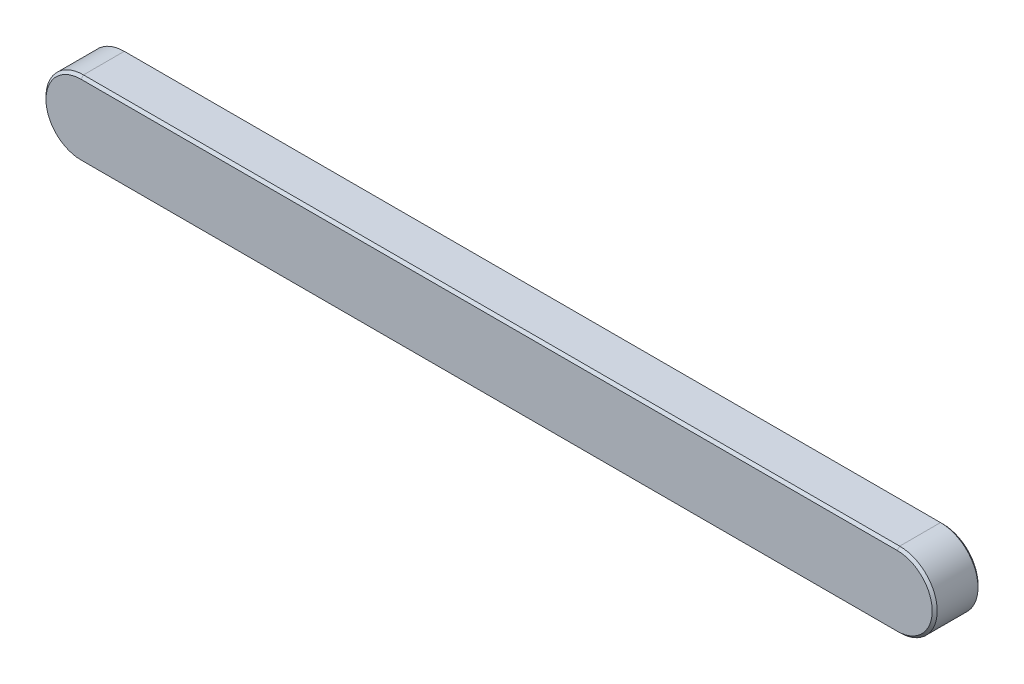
ISO-10303-21;
HEADER;
FILE_DESCRIPTION(('STEP AP214'),'2;1');
FILE_NAME('part.step','',(''),(''),'','','');
FILE_SCHEMA(('AUTOMOTIVE_DESIGN { 1 0 10303 214 1 1 1 1 }'));
ENDSEC;
DATA;
#1=APPLICATION_CONTEXT('core data for automotive mechanical design processes');
#2=APPLICATION_PROTOCOL_DEFINITION('international standard','automotive_design',2000,#1);
#3=PRODUCT_CONTEXT('',#1,'mechanical');
#4=PRODUCT('Part','Part','',(#3));
#5=PRODUCT_RELATED_PRODUCT_CATEGORY('part','',(#4));
#6=PRODUCT_DEFINITION_FORMATION('','',#4);
#7=PRODUCT_DEFINITION_CONTEXT('part definition',#1,'design');
#8=PRODUCT_DEFINITION('design','',#6,#7);
#9=PRODUCT_DEFINITION_SHAPE('','',#8);
#10=(LENGTH_UNIT() NAMED_UNIT(*) SI_UNIT(.MILLI.,.METRE.));
#11=(NAMED_UNIT(*) PLANE_ANGLE_UNIT() SI_UNIT($,.RADIAN.));
#12=(NAMED_UNIT(*) SI_UNIT($,.STERADIAN.) SOLID_ANGLE_UNIT());
#13=UNCERTAINTY_MEASURE_WITH_UNIT(LENGTH_MEASURE(1.E-05),#10,'distance_accuracy_value','');
#14=(GEOMETRIC_REPRESENTATION_CONTEXT(3) GLOBAL_UNCERTAINTY_ASSIGNED_CONTEXT((#13)) GLOBAL_UNIT_ASSIGNED_CONTEXT((#10,
#11,#12)) REPRESENTATION_CONTEXT('',''));
#15=CARTESIAN_POINT('',(0.,0.,0.));
#16=DIRECTION('',(0.,0.,1.));
#17=DIRECTION('',(1.,0.,0.));
#18=AXIS2_PLACEMENT_3D('',#15,#16,#17);
#19=CARTESIAN_POINT('',(0.,9.,11.));
#20=DIRECTION('',(0.,0.,-1.));
#21=DIRECTION('',(-1.,0.,0.));
#22=AXIS2_PLACEMENT_3D('',#19,#20,#21);
#23=CYLINDRICAL_SURFACE('',#22,9.);
#24=DIRECTION('',(0.,0.,-1.));
#25=VECTOR('',#24,1.);
#26=CARTESIAN_POINT('',(0.,0.,11.));
#27=LINE('',#26,#25);
#28=CARTESIAN_POINT('',(0.,0.,10.4));
#29=VERTEX_POINT('',#28);
#30=CARTESIAN_POINT('',(0.,0.,0.600000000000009));
#31=VERTEX_POINT('',#30);
#32=EDGE_CURVE('E117',#29,#31,#27,.T.);
#33=ORIENTED_EDGE('',*,*,#32,.F.);
#34=CARTESIAN_POINT('',(0.,9.,10.4));
#35=DIRECTION('',(0.,0.,-1.));
#36=DIRECTION('',(-1.,0.,0.));
#37=AXIS2_PLACEMENT_3D('',#34,#35,#36);
#38=CIRCLE('',#37,9.);
#39=CARTESIAN_POINT('',(0.,18.,10.4));
#40=VERTEX_POINT('',#39);
#41=EDGE_CURVE('E141',#29,#40,#38,.T.);
#42=ORIENTED_EDGE('',*,*,#41,.T.);
#43=DIRECTION('',(0.,0.,-1.));
#44=VECTOR('',#43,1.);
#45=CARTESIAN_POINT('',(0.,18.,11.));
#46=LINE('',#45,#44);
#47=CARTESIAN_POINT('',(0.,18.,0.600000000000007));
#48=VERTEX_POINT('',#47);
#49=EDGE_CURVE('E152',#40,#48,#46,.T.);
#50=ORIENTED_EDGE('',*,*,#49,.T.);
#51=CARTESIAN_POINT('',(-1.11022302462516E-13,9.,0.600000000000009));
#52=DIRECTION('',(0.,0.,-1.));
#53=DIRECTION('',(-1.,0.,0.));
#54=AXIS2_PLACEMENT_3D('',#51,#52,#53);
#55=CIRCLE('',#54,9.);
#56=EDGE_CURVE('E139',#48,#31,#55,.F.);
#57=ORIENTED_EDGE('',*,*,#56,.T.);
#58=EDGE_LOOP('',(#33,#42,#50,#57));
#59=FACE_BOUND('',#58,.T.);
#60=ADVANCED_FACE('F32',(#59),#23,.T.);
#61=CARTESIAN_POINT('',(0.,0.,11.));
#62=DIRECTION('',(0.,1.,0.));
#63=DIRECTION('',(-1.,0.,0.));
#64=AXIS2_PLACEMENT_3D('',#61,#62,#63);
#65=PLANE('',#64);
#66=DIRECTION('',(0.,0.,-1.));
#67=VECTOR('',#66,1.);
#68=CARTESIAN_POINT('',(196.,0.,11.));
#69=LINE('',#68,#67);
#70=CARTESIAN_POINT('',(196.,0.,10.4));
#71=VERTEX_POINT('',#70);
#72=CARTESIAN_POINT('',(196.,0.,0.600000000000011));
#73=VERTEX_POINT('',#72);
#74=EDGE_CURVE('E279',#71,#73,#69,.T.);
#75=ORIENTED_EDGE('',*,*,#74,.F.);
#76=DIRECTION('',(-1.,0.,0.));
#77=VECTOR('',#76,1.);
#78=CARTESIAN_POINT('',(0.,0.,10.4));
#79=LINE('',#78,#77);
#80=EDGE_CURVE('E137',#71,#29,#79,.T.);
#81=ORIENTED_EDGE('',*,*,#80,.T.);
#82=ORIENTED_EDGE('',*,*,#32,.T.);
#83=DIRECTION('',(1.,0.,0.));
#84=VECTOR('',#83,1.);
#85=CARTESIAN_POINT('',(196.,0.,0.600000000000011));
#86=LINE('',#85,#84);
#87=EDGE_CURVE('E134',#31,#73,#86,.T.);
#88=ORIENTED_EDGE('',*,*,#87,.T.);
#89=EDGE_LOOP('',(#75,#81,#82,#88));
#90=FACE_BOUND('',#89,.T.);
#91=ADVANCED_FACE('F189',(#90),#65,.F.);
#92=CARTESIAN_POINT('',(196.,9.,11.));
#93=DIRECTION('',(0.,0.,-1.));
#94=DIRECTION('',(-1.,0.,0.));
#95=AXIS2_PLACEMENT_3D('',#92,#93,#94);
#96=CYLINDRICAL_SURFACE('',#95,9.);
#97=DIRECTION('',(0.,0.,-1.));
#98=VECTOR('',#97,1.);
#99=CARTESIAN_POINT('',(196.,18.,11.));
#100=LINE('',#99,#98);
#101=CARTESIAN_POINT('',(196.,18.,10.4));
#102=VERTEX_POINT('',#101);
#103=CARTESIAN_POINT('',(196.,18.,0.600000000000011));
#104=VERTEX_POINT('',#103);
#105=EDGE_CURVE('E275',#102,#104,#100,.T.);
#106=ORIENTED_EDGE('',*,*,#105,.F.);
#107=CARTESIAN_POINT('',(196.,9.,10.4));
#108=DIRECTION('',(0.,0.,-1.));
#109=DIRECTION('',(-1.,0.,0.));
#110=AXIS2_PLACEMENT_3D('',#107,#108,#109);
#111=CIRCLE('',#110,9.);
#112=EDGE_CURVE('E132',#102,#71,#111,.T.);
#113=ORIENTED_EDGE('',*,*,#112,.T.);
#114=ORIENTED_EDGE('',*,*,#74,.T.);
#115=CARTESIAN_POINT('',(196.,9.00000000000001,0.600000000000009));
#116=DIRECTION('',(0.,0.,-1.));
#117=DIRECTION('',(-1.,0.,0.));
#118=AXIS2_PLACEMENT_3D('',#115,#116,#117);
#119=CIRCLE('',#118,9.);
#120=EDGE_CURVE('E130',#73,#104,#119,.F.);
#121=ORIENTED_EDGE('',*,*,#120,.T.);
#122=EDGE_LOOP('',(#106,#113,#114,#121));
#123=FACE_BOUND('',#122,.T.);
#124=ADVANCED_FACE('F195',(#123),#96,.T.);
#125=CARTESIAN_POINT('',(0.,18.,11.));
#126=DIRECTION('',(0.,-1.,0.));
#127=DIRECTION('',(0.,0.,-1.));
#128=AXIS2_PLACEMENT_3D('',#125,#126,#127);
#129=PLANE('',#128);
#130=ORIENTED_EDGE('',*,*,#49,.F.);
#131=DIRECTION('',(1.,0.,0.));
#132=VECTOR('',#131,1.);
#133=CARTESIAN_POINT('',(0.,18.,10.4));
#134=LINE('',#133,#132);
#135=EDGE_CURVE('E104',#40,#102,#134,.T.);
#136=ORIENTED_EDGE('',*,*,#135,.T.);
#137=ORIENTED_EDGE('',*,*,#105,.T.);
#138=DIRECTION('',(-1.,0.,0.));
#139=VECTOR('',#138,1.);
#140=CARTESIAN_POINT('',(0.,18.,0.600000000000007));
#141=LINE('',#140,#139);
#142=EDGE_CURVE('E123',#104,#48,#141,.T.);
#143=ORIENTED_EDGE('',*,*,#142,.T.);
#144=EDGE_LOOP('',(#130,#136,#137,#143));
#145=FACE_BOUND('',#144,.T.);
#146=ADVANCED_FACE('F185',(#145),#129,.F.);
#147=CARTESIAN_POINT('',(0.,9.,11.));
#148=DIRECTION('',(0.,0.,-1.));
#149=DIRECTION('',(-1.,0.,0.));
#150=AXIS2_PLACEMENT_3D('',#147,#148,#149);
#151=PLANE('',#150);
#152=CARTESIAN_POINT('',(196.,9.,11.));
#153=DIRECTION('',(0.,0.,-1.));
#154=DIRECTION('',(-1.,0.,0.));
#155=AXIS2_PLACEMENT_3D('',#152,#153,#154);
#156=CIRCLE('',#155,8.39999999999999);
#157=CARTESIAN_POINT('',(196.,0.600000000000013,11.));
#158=VERTEX_POINT('',#157);
#159=CARTESIAN_POINT('',(196.,17.4,11.));
#160=VERTEX_POINT('',#159);
#161=EDGE_CURVE('E121',#158,#160,#156,.F.);
#162=ORIENTED_EDGE('',*,*,#161,.T.);
#163=DIRECTION('',(-1.,0.,0.));
#164=VECTOR('',#163,1.);
#165=CARTESIAN_POINT('',(0.,17.4,11.));
#166=LINE('',#165,#164);
#167=CARTESIAN_POINT('',(0.,17.4,11.));
#168=VERTEX_POINT('',#167);
#169=EDGE_CURVE('E102',#160,#168,#166,.T.);
#170=ORIENTED_EDGE('',*,*,#169,.T.);
#171=CARTESIAN_POINT('',(0.,9.,11.));
#172=DIRECTION('',(0.,0.,-1.));
#173=DIRECTION('',(-1.,0.,0.));
#174=AXIS2_PLACEMENT_3D('',#171,#172,#173);
#175=CIRCLE('',#174,8.4);
#176=CARTESIAN_POINT('',(0.,0.599999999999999,11.));
#177=VERTEX_POINT('',#176);
#178=EDGE_CURVE('E110',#168,#177,#175,.F.);
#179=ORIENTED_EDGE('',*,*,#178,.T.);
#180=DIRECTION('',(1.,0.,0.));
#181=VECTOR('',#180,1.);
#182=CARTESIAN_POINT('',(0.,0.60000000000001,11.));
#183=LINE('',#182,#181);
#184=EDGE_CURVE('E116',#177,#158,#183,.T.);
#185=ORIENTED_EDGE('',*,*,#184,.T.);
#186=EDGE_LOOP('',(#162,#170,#179,#185));
#187=FACE_BOUND('',#186,.T.);
#188=ADVANCED_FACE('F119',(#187),#151,.F.);
#189=CARTESIAN_POINT('',(-1.11022302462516E-13,9.,0.));
#190=DIRECTION('',(0.,0.,-1.));
#191=DIRECTION('',(-1.,0.,0.));
#192=AXIS2_PLACEMENT_3D('',#189,#190,#191);
#193=PLANE('',#192);
#194=CARTESIAN_POINT('',(196.,9.00000000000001,0.));
#195=DIRECTION('',(0.,0.,-1.));
#196=DIRECTION('',(-1.,0.,0.));
#197=AXIS2_PLACEMENT_3D('',#194,#195,#196);
#198=CIRCLE('',#197,8.4);
#199=CARTESIAN_POINT('',(196.,17.4,0.));
#200=VERTEX_POINT('',#199);
#201=CARTESIAN_POINT('',(196.,0.600000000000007,0.));
#202=VERTEX_POINT('',#201);
#203=EDGE_CURVE('E41',#200,#202,#198,.T.);
#204=ORIENTED_EDGE('',*,*,#203,.T.);
#205=DIRECTION('',(-1.,0.,0.));
#206=VECTOR('',#205,1.);
#207=CARTESIAN_POINT('',(0.,0.600000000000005,0.));
#208=LINE('',#207,#206);
#209=CARTESIAN_POINT('',(0.,0.599999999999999,0.));
#210=VERTEX_POINT('',#209);
#211=EDGE_CURVE('E11',#202,#210,#208,.T.);
#212=ORIENTED_EDGE('',*,*,#211,.T.);
#213=CARTESIAN_POINT('',(-1.11022302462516E-13,9.,0.));
#214=DIRECTION('',(0.,0.,-1.));
#215=DIRECTION('',(-1.,0.,0.));
#216=AXIS2_PLACEMENT_3D('',#213,#214,#215);
#217=CIRCLE('',#216,8.4);
#218=CARTESIAN_POINT('',(0.,17.4,0.));
#219=VERTEX_POINT('',#218);
#220=EDGE_CURVE('E143',#210,#219,#217,.T.);
#221=ORIENTED_EDGE('',*,*,#220,.T.);
#222=DIRECTION('',(1.,0.,0.));
#223=VECTOR('',#222,1.);
#224=CARTESIAN_POINT('',(196.,17.4,0.));
#225=LINE('',#224,#223);
#226=EDGE_CURVE('E52',#219,#200,#225,.T.);
#227=ORIENTED_EDGE('',*,*,#226,.T.);
#228=EDGE_LOOP('',(#204,#212,#221,#227));
#229=FACE_BOUND('',#228,.T.);
#230=ADVANCED_FACE('F174',(#229),#193,.T.);
#231=CARTESIAN_POINT('',(0.,0.60000000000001,11.));
#232=DIRECTION('',(0.,0.707106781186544,-0.707106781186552));
#233=DIRECTION('',(0.,0.707106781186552,0.707106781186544));
#234=AXIS2_PLACEMENT_3D('',#231,#232,#233);
#235=PLANE('',#234);
#236=DIRECTION('',(0.,0.707106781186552,0.707106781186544));
#237=VECTOR('',#236,1.);
#238=CARTESIAN_POINT('',(0.,0.,10.4));
#239=LINE('',#238,#237);
#240=EDGE_CURVE('E113',#29,#177,#239,.T.);
#241=ORIENTED_EDGE('',*,*,#240,.F.);
#242=ORIENTED_EDGE('',*,*,#80,.F.);
#243=DIRECTION('',(0.,-0.707106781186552,-0.707106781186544));
#244=VECTOR('',#243,1.);
#245=CARTESIAN_POINT('',(196.,0.600000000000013,11.));
#246=LINE('',#245,#244);
#247=EDGE_CURVE('E149',#158,#71,#246,.T.);
#248=ORIENTED_EDGE('',*,*,#247,.F.);
#249=ORIENTED_EDGE('',*,*,#184,.F.);
#250=EDGE_LOOP('',(#241,#242,#248,#249));
#251=FACE_BOUND('',#250,.T.);
#252=ADVANCED_FACE('F176',(#251),#235,.F.);
#253=CARTESIAN_POINT('',(196.,9.,11.));
#254=DIRECTION('',(0.,0.,-1.));
#255=DIRECTION('',(-1.,0.,0.));
#256=AXIS2_PLACEMENT_3D('',#253,#254,#255);
#257=CONICAL_SURFACE('',#256,8.39999999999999,0.785398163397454);
#258=ORIENTED_EDGE('',*,*,#247,.T.);
#259=ORIENTED_EDGE('',*,*,#112,.F.);
#260=DIRECTION('',(0.,0.707106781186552,-0.707106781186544));
#261=VECTOR('',#260,1.);
#262=CARTESIAN_POINT('',(196.,17.4,11.));
#263=LINE('',#262,#261);
#264=EDGE_CURVE('E107',#160,#102,#263,.T.);
#265=ORIENTED_EDGE('',*,*,#264,.F.);
#266=ORIENTED_EDGE('',*,*,#161,.F.);
#267=EDGE_LOOP('',(#258,#259,#265,#266));
#268=FACE_BOUND('',#267,.T.);
#269=ADVANCED_FACE('F182',(#268),#257,.T.);
#270=CARTESIAN_POINT('',(0.,9.,11.));
#271=DIRECTION('',(0.,0.,-1.));
#272=DIRECTION('',(-1.,0.,0.));
#273=AXIS2_PLACEMENT_3D('',#270,#271,#272);
#274=CONICAL_SURFACE('',#273,8.4,0.785398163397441);
#275=ORIENTED_EDGE('',*,*,#240,.T.);
#276=ORIENTED_EDGE('',*,*,#178,.F.);
#277=DIRECTION('',(0.,-0.707106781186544,0.707106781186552));
#278=VECTOR('',#277,1.);
#279=CARTESIAN_POINT('',(0.,18.,10.4));
#280=LINE('',#279,#278);
#281=EDGE_CURVE('E98',#40,#168,#280,.T.);
#282=ORIENTED_EDGE('',*,*,#281,.F.);
#283=ORIENTED_EDGE('',*,*,#41,.F.);
#284=EDGE_LOOP('',(#275,#276,#282,#283));
#285=FACE_BOUND('',#284,.T.);
#286=ADVANCED_FACE('F111',(#285),#274,.T.);
#287=CARTESIAN_POINT('',(0.,17.4,11.));
#288=DIRECTION('',(0.,-0.707106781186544,-0.707106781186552));
#289=DIRECTION('',(0.,0.707106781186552,-0.707106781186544));
#290=AXIS2_PLACEMENT_3D('',#287,#288,#289);
#291=PLANE('',#290);
#292=ORIENTED_EDGE('',*,*,#264,.T.);
#293=ORIENTED_EDGE('',*,*,#135,.F.);
#294=ORIENTED_EDGE('',*,*,#281,.T.);
#295=ORIENTED_EDGE('',*,*,#169,.F.);
#296=EDGE_LOOP('',(#292,#293,#294,#295));
#297=FACE_BOUND('',#296,.T.);
#298=ADVANCED_FACE('F100',(#297),#291,.F.);
#299=CARTESIAN_POINT('',(0.,18.,0.600000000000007));
#300=DIRECTION('',(0.,0.707106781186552,-0.707106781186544));
#301=DIRECTION('',(0.,0.707106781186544,0.707106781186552));
#302=AXIS2_PLACEMENT_3D('',#299,#300,#301);
#303=PLANE('',#302);
#304=DIRECTION('',(0.,0.707106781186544,0.707106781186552));
#305=VECTOR('',#304,1.);
#306=CARTESIAN_POINT('',(196.,17.4,0.));
#307=LINE('',#306,#305);
#308=EDGE_CURVE('E156',#200,#104,#307,.T.);
#309=ORIENTED_EDGE('',*,*,#308,.F.);
#310=ORIENTED_EDGE('',*,*,#226,.F.);
#311=DIRECTION('',(0.,-0.707106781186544,-0.707106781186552));
#312=VECTOR('',#311,1.);
#313=CARTESIAN_POINT('',(0.,18.,0.600000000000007));
#314=LINE('',#313,#312);
#315=EDGE_CURVE('E36',#48,#219,#314,.T.);
#316=ORIENTED_EDGE('',*,*,#315,.F.);
#317=ORIENTED_EDGE('',*,*,#142,.F.);
#318=EDGE_LOOP('',(#309,#310,#316,#317));
#319=FACE_BOUND('',#318,.T.);
#320=ADVANCED_FACE('F34',(#319),#303,.T.);
#321=CARTESIAN_POINT('',(-1.11022302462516E-13,9.,0.600000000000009));
#322=DIRECTION('',(0.,0.,1.));
#323=DIRECTION('',(1.,0.,0.));
#324=AXIS2_PLACEMENT_3D('',#321,#322,#323);
#325=CONICAL_SURFACE('',#324,9.,0.785398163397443);
#326=ORIENTED_EDGE('',*,*,#315,.T.);
#327=ORIENTED_EDGE('',*,*,#220,.F.);
#328=DIRECTION('',(0.,0.707106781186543,-0.707106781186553));
#329=VECTOR('',#328,1.);
#330=CARTESIAN_POINT('',(0.,0.,0.600000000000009));
#331=LINE('',#330,#329);
#332=EDGE_CURVE('E155',#31,#210,#331,.T.);
#333=ORIENTED_EDGE('',*,*,#332,.F.);
#334=ORIENTED_EDGE('',*,*,#56,.F.);
#335=EDGE_LOOP('',(#326,#327,#333,#334));
#336=FACE_BOUND('',#335,.T.);
#337=ADVANCED_FACE('F165',(#336),#325,.T.);
#338=CARTESIAN_POINT('',(196.,9.00000000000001,0.600000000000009));
#339=DIRECTION('',(0.,0.,1.));
#340=DIRECTION('',(1.,0.,0.));
#341=AXIS2_PLACEMENT_3D('',#338,#339,#340);
#342=CONICAL_SURFACE('',#341,9.,0.785398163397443);
#343=ORIENTED_EDGE('',*,*,#308,.T.);
#344=ORIENTED_EDGE('',*,*,#120,.F.);
#345=DIRECTION('',(0.,-0.707106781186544,0.707106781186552));
#346=VECTOR('',#345,1.);
#347=CARTESIAN_POINT('',(196.,0.600000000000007,0.));
#348=LINE('',#347,#346);
#349=EDGE_CURVE('E153',#202,#73,#348,.T.);
#350=ORIENTED_EDGE('',*,*,#349,.F.);
#351=ORIENTED_EDGE('',*,*,#203,.F.);
#352=EDGE_LOOP('',(#343,#344,#350,#351));
#353=FACE_BOUND('',#352,.T.);
#354=ADVANCED_FACE('F170',(#353),#342,.T.);
#355=CARTESIAN_POINT('',(0.,0.,0.600000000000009));
#356=DIRECTION('',(0.,-0.707106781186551,-0.707106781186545));
#357=DIRECTION('',(0.,0.707106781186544,-0.707106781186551));
#358=AXIS2_PLACEMENT_3D('',#355,#356,#357);
#359=PLANE('',#358);
#360=ORIENTED_EDGE('',*,*,#332,.T.);
#361=ORIENTED_EDGE('',*,*,#211,.F.);
#362=ORIENTED_EDGE('',*,*,#349,.T.);
#363=ORIENTED_EDGE('',*,*,#87,.F.);
#364=EDGE_LOOP('',(#360,#361,#362,#363));
#365=FACE_BOUND('',#364,.T.);
#366=ADVANCED_FACE('F173',(#365),#359,.T.);
#367=CLOSED_SHELL('',(#60,#91,#124,#146,#188,#230,#252,#269,#286,#298,#320,#337,#354,#366));
#368=MANIFOLD_SOLID_BREP('B2',#367);
#369=ADVANCED_BREP_SHAPE_REPRESENTATION('',(#18,#368),#14);
#370=SHAPE_DEFINITION_REPRESENTATION(#9,#369);
ENDSEC;
END-ISO-10303-21;
